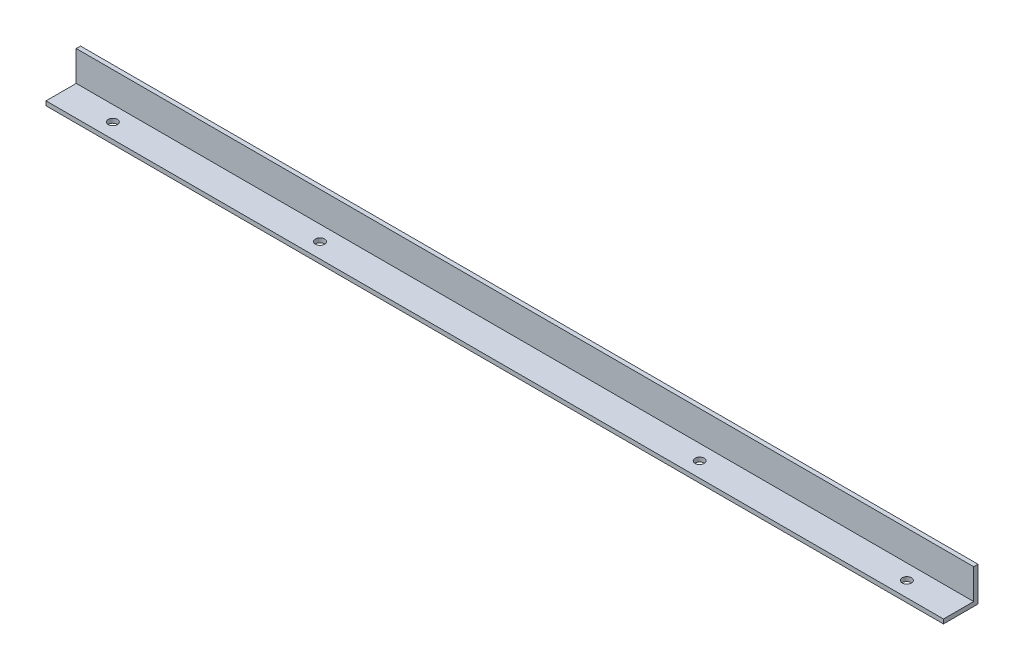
from build123d import *

# Parameters (mm, degrees)
SKETCH1_W           = 660.4
SKETCH1_H           = 25.4
BOSS_EXTRUDE1_DEPTH = 3.175
SKETCH2_W           = 660.4
SKETCH2_H           = 3.175
BOSS_EXTRUDE2_DEPTH = 22.225
SKETCH3_R           = 3.3782
CUT_EXTRUDE1_DEPTH  = 332.190701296


with BuildPart() as part:
    # Sketch1 → Boss-Extrude1 (new body)
    with BuildSketch(Plane(origin=(0, 0, 0), x_dir=(1, 0, 0), z_dir=(0, 1, 0))):
        Rectangle(SKETCH1_W, SKETCH1_H)
    extrude(amount=BOSS_EXTRUDE1_DEPTH)

    # Sketch2 → Boss-Extrude2 (add)
    with BuildSketch(Plane(origin=(0, 3.175, 0), x_dir=(1, 0, 0), z_dir=(0, 1, 0))):
        with Locations((0, 11.1125)):
            Rectangle(SKETCH2_W, SKETCH2_H)
    extrude(amount=BOSS_EXTRUDE2_DEPTH)

    # Sketch3 → Cut-Extrude1 (cut, through all)
    with BuildSketch(Plane(origin=(0, 3.175, 0), x_dir=(1, 0, 0), z_dir=(0, 1, 0))):
        with Locations(Location((-292.1, -1.5875, 0), (0, 0, 270))):
            Circle(SKETCH3_R)
        with Locations(Location((-139.7, -1.5875, 0), (0, 0, 270))):
            Circle(SKETCH3_R)
        with Locations(Location((292.1, -1.5875, 0), (0, 0, 270))):
            Circle(SKETCH3_R)
        with Locations(Location((139.7, -1.5875, 0), (0, 0, 270))):
            Circle(SKETCH3_R)
    extrude(amount=-CUT_EXTRUDE1_DEPTH, mode=Mode.SUBTRACT)


solid = part.part
